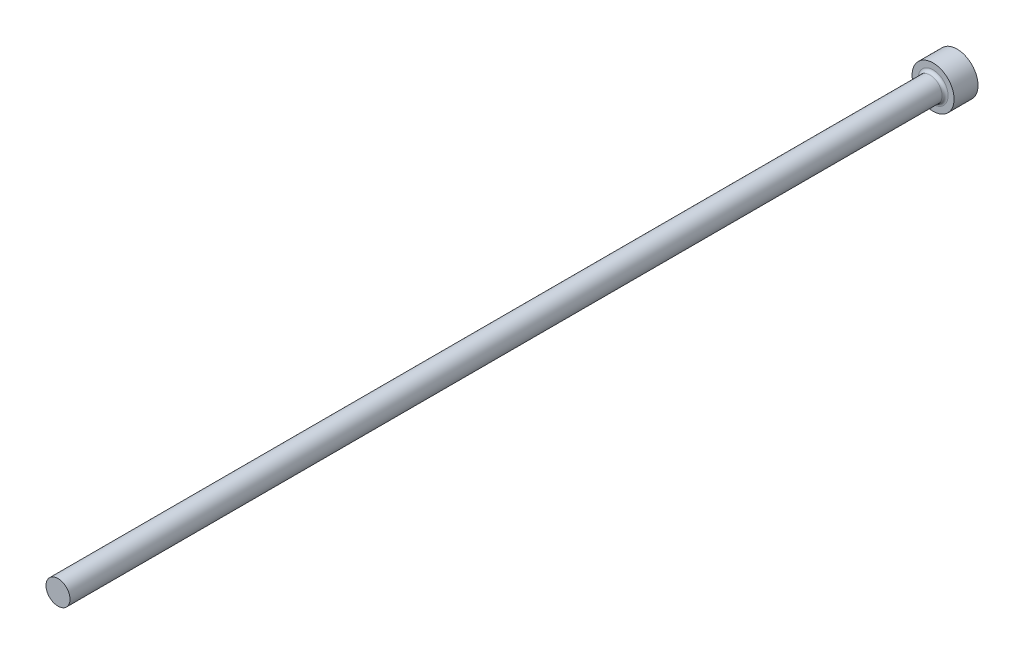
from build123d import *

# Parameters (mm, degrees)
FILLET1_R = 0.5


with BuildPart() as part:
    # FV → Revolve1 (revolve)
    with BuildSketch(Plane(origin=(0, 0, 0), x_dir=(1, 0, 0), z_dir=(0, 1, 0)), mode=Mode.PRIVATE) as revolve1_sk:
        Polygon((0, 0), (3.5, 0), (3.5, -4), (2, -4), (2, -150), (0, -150), align=None)
    revolve(revolve1_sk.sketch.rotate(Axis((0, 0, -9.033228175), (0, 0, 1)), 180), axis=Axis((0, 0, -9.033228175), (0, 0, 1)))

    # Fillet1
    fillet1_edges = [part.edges().sort_by_distance(p)[0] for p in [
        (2, 0, 4),
    ]]
    fillet(fillet1_edges, radius=FILLET1_R)


solid = part.part
